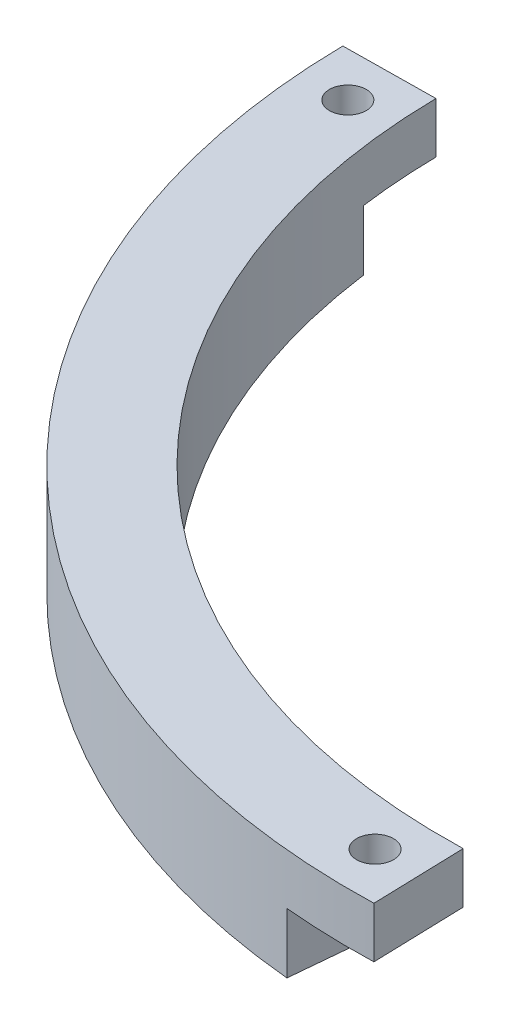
from build123d import *

# Parameters (mm, degrees)
SKETCH1_W                      = 7.366
SKETCH1_H                      = 8.89
REVOLVE1_ANGLE                 = 290
SKETCH2_OUTSIDE_W              = 153.238
SKETCH2_OUTSIDE_H              = 153.238
CUT_EXTRUDE1_DEPTH             = 84.809608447
CUT_EXTRUDE2_START             = -4.826
CUT_EXTRUDE2_DEPTH             = 4.826
F_32_0_116000_DIAMETER_HOLE2_D = 2.9464


with BuildPart() as part:
    # Sketch1 → Revolve1 (revolve)
    with BuildSketch(Plane.XY):
        with Locations((55.245, -40.2082)):
            Rectangle(SKETCH1_W, SKETCH1_H)
    revolve(axis=Axis((0, 0, 0), (0, -1, 0)), revolution_arc=REVOLVE1_ANGLE)

    # Sketch2 outside → Cut-Extrude1 (cut, through all)
    with BuildSketch(Plane(origin=(0, -35.7632, 0), x_dir=(-1, 0, 0), z_dir=(0, 1, 0))):
        Rectangle(SKETCH2_OUTSIDE_W, SKETCH2_OUTSIDE_H)
        with BuildLine():
            Line((0, 0), (58.923602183, 0.719923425))
            ThreePointArc((58.923602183, 0.719923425), (40.78661295, 42.531886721), (-1.748172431, 58.902063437))
            Line((-1.748172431, 58.902063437), (0, 0))
        make_face(mode=Mode.SUBTRACT)
    extrude(amount=-CUT_EXTRUDE1_DEPTH, mode=Mode.SUBTRACT)

    # Sketch3 → Cut-Extrude2 (cut)
    with BuildSketch(Plane.XZ.offset(44.6532).offset(CUT_EXTRUDE2_START)):
        with BuildLine():
            Line((0, 0), (-5.443213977, 58.676065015))
            ThreePointArc((-5.443213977, 58.676065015), (40.78661295, -42.531886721), (-58.396657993, 7.895537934))
            Line((-58.396657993, 7.895537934), (0, 0))
        make_face()
    extrude(amount=CUT_EXTRUDE2_DEPTH, mode=Mode.SUBTRACT)

    # 32 _0.116000_ Diameter Hole2 (through all)
    with Locations(Plane(origin=(0, -35.7632, 0), x_dir=(-1, 0, 0), z_dir=(0, 1, 0))):
        with Locations((54.977404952, 4.262735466), (1.95678155, 55.107685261)):
            Hole(F_32_0_116000_DIAMETER_HOLE2_D / 2)


solid = part.part
